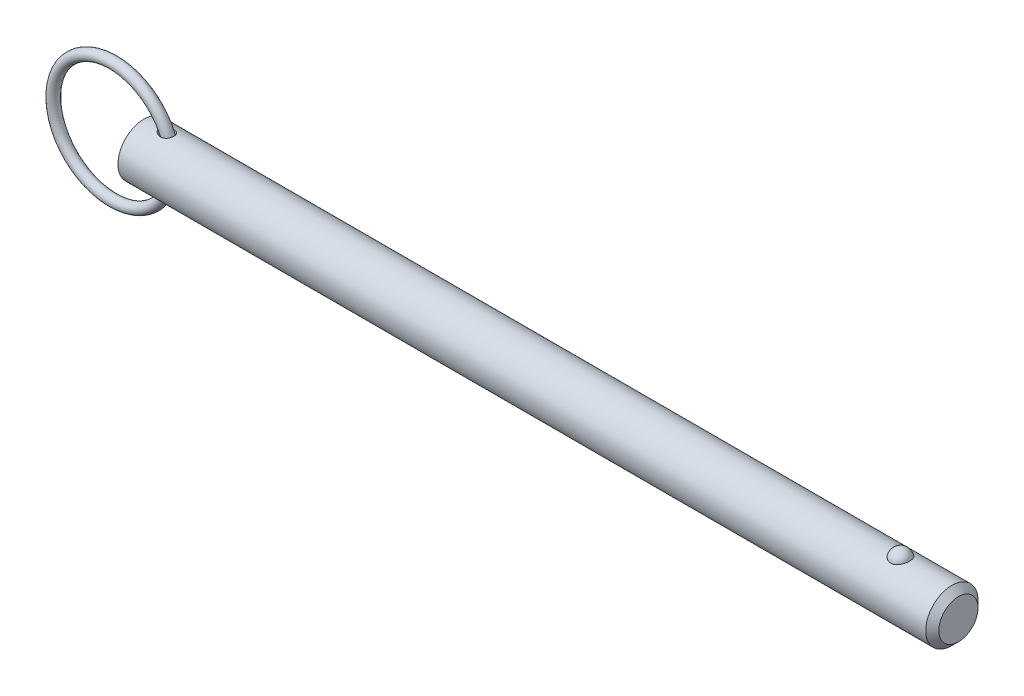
ISO-10303-21;
HEADER;
FILE_DESCRIPTION(('STEP AP214'),'2;1');
FILE_NAME('part.step','',(''),(''),'','','');
FILE_SCHEMA(('AUTOMOTIVE_DESIGN { 1 0 10303 214 1 1 1 1 }'));
ENDSEC;
DATA;
#1=APPLICATION_CONTEXT('core data for automotive mechanical design processes');
#2=APPLICATION_PROTOCOL_DEFINITION('international standard','automotive_design',2000,#1);
#3=PRODUCT_CONTEXT('',#1,'mechanical');
#4=PRODUCT('Part','Part','',(#3));
#5=PRODUCT_RELATED_PRODUCT_CATEGORY('part','',(#4));
#6=PRODUCT_DEFINITION_FORMATION('','',#4);
#7=PRODUCT_DEFINITION_CONTEXT('part definition',#1,'design');
#8=PRODUCT_DEFINITION('design','',#6,#7);
#9=PRODUCT_DEFINITION_SHAPE('','',#8);
#10=(LENGTH_UNIT() NAMED_UNIT(*) SI_UNIT(.MILLI.,.METRE.));
#11=(NAMED_UNIT(*) PLANE_ANGLE_UNIT() SI_UNIT($,.RADIAN.));
#12=(NAMED_UNIT(*) SI_UNIT($,.STERADIAN.) SOLID_ANGLE_UNIT());
#13=UNCERTAINTY_MEASURE_WITH_UNIT(LENGTH_MEASURE(1.E-05),#10,'distance_accuracy_value','');
#14=(GEOMETRIC_REPRESENTATION_CONTEXT(3) GLOBAL_UNCERTAINTY_ASSIGNED_CONTEXT((#13)) GLOBAL_UNIT_ASSIGNED_CONTEXT((#10,
#11,#12)) REPRESENTATION_CONTEXT('',''));
#15=CARTESIAN_POINT('',(0.,0.,0.));
#16=DIRECTION('',(0.,0.,1.));
#17=DIRECTION('',(1.,0.,0.));
#18=AXIS2_PLACEMENT_3D('',#15,#16,#17);
#19=CARTESIAN_POINT('',(-6.5973878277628,0.,0.));
#20=DIRECTION('',(0.,0.,1.));
#21=DIRECTION('',(1.,0.,0.));
#22=AXIS2_PLACEMENT_3D('',#19,#20,#21);
#23=TOROIDAL_SURFACE('',#22,12.7,1.111);
#24=CARTESIAN_POINT('',(7.21361217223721,0.,0.));
#25=VERTEX_POINT('',#24);
#26=VERTEX_LOOP('',#25);
#27=FACE_BOUND('',#26,.T.);
#28=ADVANCED_FACE('P0_F12',(#27),#23,.T.);
#29=CLOSED_SHELL('',(#28));
#30=MANIFOLD_SOLID_BREP('P0_B1',#29);
#31=CARTESIAN_POINT('',(0.,0.,0.));
#32=DIRECTION('',(1.,0.,0.));
#33=DIRECTION('',(0.,0.,-1.));
#34=AXIS2_PLACEMENT_3D('',#31,#32,#33);
#35=CYLINDRICAL_SURFACE('',#34,5.555);
#36=CARTESIAN_POINT('',(3.4079629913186,5.52646850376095,-0.56229074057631));
#37=CARTESIAN_POINT('',(3.45038002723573,5.51879026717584,-0.637753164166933));
#38=CARTESIAN_POINT('',(3.50032814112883,5.50998541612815,-0.70889136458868));
#39=CARTESIAN_POINT('',(3.61174203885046,5.49132550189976,-0.841353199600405));
#40=CARTESIAN_POINT('',(3.67323300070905,5.48146816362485,-0.902654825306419));
#41=CARTESIAN_POINT('',(3.80437942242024,5.46186986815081,-1.01449227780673));
#42=CARTESIAN_POINT('',(3.87396236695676,5.45212862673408,-1.06511378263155));
#43=CARTESIAN_POINT('',(4.01965973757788,5.43359578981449,-1.15594541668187));
#44=CARTESIAN_POINT('',(4.09577226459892,5.42480391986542,-1.19615855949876));
#45=CARTESIAN_POINT('',(4.26620236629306,5.40764958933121,-1.27165209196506));
#46=CARTESIAN_POINT('',(4.36143030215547,5.3996073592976,-1.30496908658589));
#47=CARTESIAN_POINT('',(4.55632904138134,5.38707461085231,-1.35578120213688));
#48=CARTESIAN_POINT('',(4.65600230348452,5.38258608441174,-1.37326745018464));
#49=CARTESIAN_POINT('',(4.85802759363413,5.37803111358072,-1.3910078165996));
#50=CARTESIAN_POINT('',(4.96039620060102,5.37800782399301,-1.39109376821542));
#51=CARTESIAN_POINT('',(5.16321961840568,5.38288845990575,-1.37209481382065));
#52=CARTESIAN_POINT('',(5.2636766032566,5.38778639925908,-1.3530331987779));
#53=CARTESIAN_POINT('',(5.44616808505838,5.40112654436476,-1.29866014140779));
#54=CARTESIAN_POINT('',(5.52893514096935,5.40904875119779,-1.26567968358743));
#55=CARTESIAN_POINT('',(5.68656142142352,5.4273273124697,-1.18484144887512));
#56=CARTESIAN_POINT('',(5.76142575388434,5.43768208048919,-1.13699336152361));
#57=CARTESIAN_POINT('',(5.8928378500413,5.45821422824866,-1.03362464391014));
#58=CARTESIAN_POINT('',(5.95048930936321,5.4682911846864,-0.979480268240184));
#59=CARTESIAN_POINT('',(6.05543937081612,5.48805232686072,-0.861887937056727));
#60=CARTESIAN_POINT('',(6.10274018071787,5.4977365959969,-0.798441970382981));
#61=CARTESIAN_POINT('',(6.18429732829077,5.51527779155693,-0.666351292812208));
#62=CARTESIAN_POINT('',(6.21893047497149,5.52318421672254,-0.597945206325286));
#63=CARTESIAN_POINT('',(6.27643902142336,5.53669785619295,-0.456146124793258));
#64=CARTESIAN_POINT('',(6.299314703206,5.54230512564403,-0.382753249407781));
#65=CARTESIAN_POINT('',(6.33280284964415,5.55061821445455,-0.232999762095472));
#66=CARTESIAN_POINT('',(6.34340498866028,5.55332159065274,-0.156636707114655));
#67=CARTESIAN_POINT('',(6.35208224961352,5.55552923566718,-0.00315477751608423));
#68=CARTESIAN_POINT('',(6.3501570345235,5.55503341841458,0.0739641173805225));
#69=CARTESIAN_POINT('',(6.33379320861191,5.55088854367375,0.22702996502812));
#70=CARTESIAN_POINT('',(6.31931424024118,5.54722931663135,0.302972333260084));
#71=CARTESIAN_POINT('',(6.27810810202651,5.53713917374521,0.451265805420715));
#72=CARTESIAN_POINT('',(6.25138106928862,5.53070828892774,0.523616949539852));
#73=CARTESIAN_POINT('',(6.18634700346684,5.51578851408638,0.662556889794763));
#74=CARTESIAN_POINT('',(6.14805666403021,5.50730259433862,0.729153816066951));
#75=CARTESIAN_POINT('',(6.0608417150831,5.4892059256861,0.854797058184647));
#76=CARTESIAN_POINT('',(6.01191805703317,5.47959527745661,0.91384404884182));
#77=CARTESIAN_POINT('',(5.90496974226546,5.46035411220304,1.0225462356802));
#78=CARTESIAN_POINT('',(5.8469816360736,5.45072382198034,1.07223745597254));
#79=CARTESIAN_POINT('',(5.72342907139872,5.43245016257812,1.16128533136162));
#80=CARTESIAN_POINT('',(5.65786492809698,5.42380675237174,1.20064241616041));
#81=CARTESIAN_POINT('',(5.52033184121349,5.40830592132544,1.26865612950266));
#82=CARTESIAN_POINT('',(5.44830127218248,5.40146883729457,1.2971923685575));
#83=CARTESIAN_POINT('',(5.30051649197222,5.39032432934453,1.34275086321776));
#84=CARTESIAN_POINT('',(5.2247613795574,5.38601752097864,1.35977031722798));
#85=CARTESIAN_POINT('',(5.06697568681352,5.38004503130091,1.3832203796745));
#86=CARTESIAN_POINT('',(4.98483834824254,5.37854992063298,1.38896799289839));
#87=CARTESIAN_POINT('',(4.82062075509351,5.37866467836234,1.38851901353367));
#88=CARTESIAN_POINT('',(4.73854053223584,5.38027567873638,1.38231806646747));
#89=CARTESIAN_POINT('',(4.5665970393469,5.38661928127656,1.35740374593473));
#90=CARTESIAN_POINT('',(4.47694676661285,5.39169506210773,1.33731128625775));
#91=CARTESIAN_POINT('',(4.30168169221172,5.40457769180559,1.28425210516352));
#92=CARTESIAN_POINT('',(4.2160714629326,5.41238755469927,1.25127117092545));
#93=CARTESIAN_POINT('',(4.04117722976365,5.43085841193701,1.16867508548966));
#94=CARTESIAN_POINT('',(3.95261220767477,5.44174460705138,1.11757796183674));
#95=CARTESIAN_POINT('',(3.78568183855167,5.46440376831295,1.00091858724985));
#96=CARTESIAN_POINT('',(3.70730710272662,5.47617590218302,0.935369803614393));
#97=CARTESIAN_POINT('',(3.5829937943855,5.49603821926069,0.809043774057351));
#98=CARTESIAN_POINT('',(3.5339020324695,5.50429522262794,0.751392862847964));
#99=CARTESIAN_POINT('',(3.44556991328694,5.51963490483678,0.628847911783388));
#100=CARTESIAN_POINT('',(3.40631385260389,5.52671944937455,0.563965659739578));
#101=CARTESIAN_POINT('',(3.34553998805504,5.5379053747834,0.439181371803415));
#102=CARTESIAN_POINT('',(3.32216705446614,5.5423057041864,0.380214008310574));
#103=CARTESIAN_POINT('',(3.28543686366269,5.54928356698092,0.259119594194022));
#104=CARTESIAN_POINT('',(3.27207322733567,5.5518622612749,0.196994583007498));
#105=CARTESIAN_POINT('',(3.25633559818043,5.5549036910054,0.0710541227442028));
#106=CARTESIAN_POINT('',(3.25400356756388,5.5553583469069,0.00723314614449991));
#107=CARTESIAN_POINT('',(3.26064251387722,5.55407150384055,-0.119787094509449));
#108=CARTESIAN_POINT('',(3.26961302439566,5.55233009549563,-0.182986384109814));
#109=CARTESIAN_POINT('',(3.29666795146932,5.54714559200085,-0.300518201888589));
#110=CARTESIAN_POINT('',(3.31373453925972,5.54389322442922,-0.355099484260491));
#111=CARTESIAN_POINT('',(3.35543396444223,5.53607951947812,-0.461174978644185));
#112=CARTESIAN_POINT('',(3.38007019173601,5.5315175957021,-0.512667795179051));
#113=CARTESIAN_POINT('',(3.4079629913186,5.52646850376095,-0.56229074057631));
#114=B_SPLINE_CURVE_WITH_KNOTS('',3,(#36,#37,#38,#39,#40,#41,#42,#43,#44,#45,#46,#47,#48,#49,
#50,#51,#52,#53,#54,#55,#56,#57,#58,#59,#60,#61,#62,#63,#64,#65,#66,#67,#68,#69,#70,#71,#72,#73,
#74,#75,#76,#77,#78,#79,#80,#81,#82,#83,#84,#85,#86,#87,#88,#89,#90,#91,#92,#93,#94,#95,#96,#97,
#98,#99,#100,#101,#102,#103,#104,#105,#106,#107,#108,#109,#110,#111,#112,#113),.UNSPECIFIED.,
.T.,.F.,(4,2,2,2,2,2,2,2,2,2,2,2,2,2,2,2,2,2,2,2,2,2,2,2,2,2,2,2,2,2,2,2,2,2,2,2,2,2,4),(0.,
0.260459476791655,0.521493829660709,0.780346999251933,1.03912513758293,1.34137402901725,
1.64379222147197,1.94913302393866,2.25410286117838,2.52092363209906,2.78757087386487,
3.02557563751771,3.26352958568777,3.49368251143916,3.72382991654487,3.9541708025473,
4.18451788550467,4.41560824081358,4.64669600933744,4.87745174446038,5.10818684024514,
5.33801446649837,5.56783253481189,5.80013729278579,6.03249854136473,6.27855081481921,
6.5246927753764,6.79963372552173,7.07487872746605,7.38193573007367,7.68870779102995,
7.91639390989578,8.14371416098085,8.33366541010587,8.52349549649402,8.71404708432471,
8.90459080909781,9.07578823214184,9.24706243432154),.UNSPECIFIED.);
#115=CARTESIAN_POINT('',(3.4079629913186,5.52646850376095,-0.56229074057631));
#116=VERTEX_POINT('',#115);
#117=EDGE_CURVE('P1_E40',#116,#116,#114,.T.);
#118=ORIENTED_EDGE('',*,*,#117,.T.);
#119=EDGE_LOOP('',(#118));
#120=FACE_BOUND('',#119,.T.);
#121=CARTESIAN_POINT('',(171.63125,0.,0.));
#122=DIRECTION('',(1.,0.,0.));
#123=DIRECTION('',(0.,0.,-1.));
#124=AXIS2_PLACEMENT_3D('',#121,#122,#123);
#125=CIRCLE('',#124,5.555);
#126=CARTESIAN_POINT('',(171.63125,0.,-5.555));
#127=VERTEX_POINT('',#126);
#128=EDGE_CURVE('P1_E25',#127,#127,#125,.T.);
#129=ORIENTED_EDGE('',*,*,#128,.F.);
#130=EDGE_LOOP('',(#129));
#131=FACE_BOUND('',#130,.T.);
#132=CARTESIAN_POINT('',(0.,0.,0.));
#133=DIRECTION('',(1.,0.,0.));
#134=DIRECTION('',(0.,0.,-1.));
#135=AXIS2_PLACEMENT_3D('',#132,#133,#134);
#136=CIRCLE('',#135,5.555);
#137=CARTESIAN_POINT('',(0.,0.,-5.555));
#138=VERTEX_POINT('',#137);
#139=EDGE_CURVE('P1_E9',#138,#138,#136,.T.);
#140=ORIENTED_EDGE('',*,*,#139,.T.);
#141=EDGE_LOOP('',(#140));
#142=FACE_BOUND('',#141,.T.);
#143=CARTESIAN_POINT('',(160.718626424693,5.16741224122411,2.03859650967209));
#144=CARTESIAN_POINT('',(160.612949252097,5.16740893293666,2.03859990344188));
#145=CARTESIAN_POINT('',(160.50729894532,5.1707947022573,2.03008306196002));
#146=CARTESIAN_POINT('',(160.299141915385,5.18392795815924,1.99630721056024));
#147=CARTESIAN_POINT('',(160.196634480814,5.19367399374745,1.97105201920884));
#148=CARTESIAN_POINT('',(159.997771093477,5.2183916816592,1.90463997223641));
#149=CARTESIAN_POINT('',(159.901406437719,5.23335573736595,1.86350622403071));
#150=CARTESIAN_POINT('',(159.717080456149,5.26688076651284,1.76652592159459));
#151=CARTESIAN_POINT('',(159.629120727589,5.28544242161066,1.71067657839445));
#152=CARTESIAN_POINT('',(159.461265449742,5.32479845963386,1.583999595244));
#153=CARTESIAN_POINT('',(159.38166564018,5.34564089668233,1.51279545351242));
#154=CARTESIAN_POINT('',(159.23512901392,5.38697258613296,1.35828584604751));
#155=CARTESIAN_POINT('',(159.168194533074,5.40746177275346,1.27497815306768));
#156=CARTESIAN_POINT('',(159.04561039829,5.44694508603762,1.09440293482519));
#157=CARTESIAN_POINT('',(158.990598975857,5.46583143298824,0.99667783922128));
#158=CARTESIAN_POINT('',(158.896937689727,5.49908030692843,0.792961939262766));
#159=CARTESIAN_POINT('',(158.858289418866,5.513442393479,0.686970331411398));
#160=CARTESIAN_POINT('',(158.797680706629,5.536358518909,0.468019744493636));
#161=CARTESIAN_POINT('',(158.775972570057,5.54482455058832,0.35498154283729));
#162=CARTESIAN_POINT('',(158.750636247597,5.55473324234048,0.126595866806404));
#163=CARTESIAN_POINT('',(158.747007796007,5.55617600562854,0.0112484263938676));
#164=CARTESIAN_POINT('',(158.757881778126,5.55189984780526,-0.218011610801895));
#165=CARTESIAN_POINT('',(158.772315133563,5.54620821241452,-0.331928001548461));
#166=CARTESIAN_POINT('',(158.818903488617,5.52828920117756,-0.55554427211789));
#167=CARTESIAN_POINT('',(158.851058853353,5.51606169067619,-0.66524406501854));
#168=CARTESIAN_POINT('',(158.932488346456,5.48630779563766,-0.877469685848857));
#169=CARTESIAN_POINT('',(158.981781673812,5.46877547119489,-0.979987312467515));
#170=CARTESIAN_POINT('',(159.096478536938,5.43024700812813,-1.17486975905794));
#171=CARTESIAN_POINT('',(159.161883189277,5.40925062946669,-1.26723387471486));
#172=CARTESIAN_POINT('',(159.307571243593,5.36600927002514,-1.43940133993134));
#173=CARTESIAN_POINT('',(159.387885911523,5.34376173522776,-1.51917763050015));
#174=CARTESIAN_POINT('',(159.561452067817,5.30057971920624,-1.66360338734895));
#175=CARTESIAN_POINT('',(159.654702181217,5.27964509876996,-1.72825445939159));
#176=CARTESIAN_POINT('',(159.849393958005,5.24205250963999,-1.83909478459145));
#177=CARTESIAN_POINT('',(159.950590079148,5.22530519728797,-1.885684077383));
#178=CARTESIAN_POINT('',(160.160155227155,5.19750919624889,-1.96100802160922));
#179=CARTESIAN_POINT('',(160.268521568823,5.18645838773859,-1.9897493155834));
#180=CARTESIAN_POINT('',(160.483498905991,5.17184410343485,-2.02742262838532));
#181=CARTESIAN_POINT('',(160.589925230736,5.16793282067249,-2.03727608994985));
#182=CARTESIAN_POINT('',(160.802992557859,5.16698995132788,-2.03966777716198));
#183=CARTESIAN_POINT('',(160.909633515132,5.16995704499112,-2.03220932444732));
#184=CARTESIAN_POINT('',(161.116773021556,5.18222383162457,-2.00071170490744));
#185=CARTESIAN_POINT('',(161.217359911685,5.19133213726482,-1.97717337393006));
#186=CARTESIAN_POINT('',(161.413014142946,5.21467637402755,-1.91475248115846));
#187=CARTESIAN_POINT('',(161.508081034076,5.22891272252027,-1.87586867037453));
#188=CARTESIAN_POINT('',(161.692371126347,5.26137066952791,-1.78282713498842));
#189=CARTESIAN_POINT('',(161.781419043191,5.27967329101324,-1.72835124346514));
#190=CARTESIAN_POINT('',(161.949288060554,5.3181741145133,-1.60597483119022));
#191=CARTESIAN_POINT('',(162.028106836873,5.33837274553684,-1.53807126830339));
#192=CARTESIAN_POINT('',(162.177515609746,5.37968287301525,-1.38688970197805));
#193=CARTESIAN_POINT('',(162.247505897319,5.40079011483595,-1.30301744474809));
#194=CARTESIAN_POINT('',(162.373012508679,5.44074401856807,-1.12458170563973));
#195=CARTESIAN_POINT('',(162.428526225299,5.45959027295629,-1.03001630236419));
#196=CARTESIAN_POINT('',(162.525550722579,5.49369849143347,-0.829439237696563));
#197=CARTESIAN_POINT('',(162.56654838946,5.50882422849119,-0.723155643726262));
#198=CARTESIAN_POINT('',(162.631125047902,5.53310911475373,-0.504772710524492));
#199=CARTESIAN_POINT('',(162.654703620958,5.54226812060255,-0.392673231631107));
#200=CARTESIAN_POINT('',(162.684013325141,5.55370358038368,-0.165459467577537));
#201=CARTESIAN_POINT('',(162.689688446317,5.55595843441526,-0.050336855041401));
#202=CARTESIAN_POINT('',(162.682916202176,5.55329317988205,0.179288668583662));
#203=CARTESIAN_POINT('',(162.670469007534,5.54837313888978,0.293791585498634));
#204=CARTESIAN_POINT('',(162.627779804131,5.53189037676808,0.518526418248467));
#205=CARTESIAN_POINT('',(162.597598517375,5.5203503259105,0.628771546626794));
#206=CARTESIAN_POINT('',(162.520096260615,5.49182453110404,0.842318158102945));
#207=CARTESIAN_POINT('',(162.472774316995,5.47483847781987,0.945619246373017));
#208=CARTESIAN_POINT('',(162.361720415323,5.43710633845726,1.14281571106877));
#209=CARTESIAN_POINT('',(162.297921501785,5.41634501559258,1.23667048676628));
#210=CARTESIAN_POINT('',(162.155357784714,5.37334572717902,1.41185243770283));
#211=CARTESIAN_POINT('',(162.07659323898,5.35110778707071,1.49317982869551));
#212=CARTESIAN_POINT('',(161.906423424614,5.30779474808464,1.64049162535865));
#213=CARTESIAN_POINT('',(161.81510026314,5.28671324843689,1.70656877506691));
#214=CARTESIAN_POINT('',(161.62173901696,5.24804852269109,1.82201372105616));
#215=CARTESIAN_POINT('',(161.519700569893,5.23046541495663,1.87138095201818));
#216=CARTESIAN_POINT('',(161.303618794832,5.20042692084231,1.95335298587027));
#217=CARTESIAN_POINT('',(161.189260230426,5.18820192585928,1.98521734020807));
#218=CARTESIAN_POINT('',(160.956130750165,5.17169804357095,2.02783294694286));
#219=CARTESIAN_POINT('',(160.837361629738,5.16741595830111,2.03859269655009));
#220=CARTESIAN_POINT('',(160.718626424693,5.16741224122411,2.03859650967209));
#221=B_SPLINE_CURVE_WITH_KNOTS('',3,(#143,#144,#145,#146,#147,#148,#149,#150,#151,#152,#153,
#154,#155,#156,#157,#158,#159,#160,#161,#162,#163,#164,#165,#166,#167,#168,#169,#170,#171,#172,
#173,#174,#175,#176,#177,#178,#179,#180,#181,#182,#183,#184,#185,#186,#187,#188,#189,#190,#191,
#192,#193,#194,#195,#196,#197,#198,#199,#200,#201,#202,#203,#204,#205,#206,#207,#208,#209,#210,
#211,#212,#213,#214,#215,#216,#217,#218,#219,#220),.UNSPECIFIED.,.T.,.F.,(4,2,2,2,2,2,2,2,2,2,2,
2,2,2,2,2,2,2,2,2,2,2,2,2,2,2,2,2,2,2,2,2,2,2,2,2,2,2,4),(0.,0.316595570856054,
0.633118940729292,0.949183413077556,1.26530783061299,1.59030762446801,1.91536729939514,
2.2549582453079,2.59458224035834,2.93917283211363,3.2837583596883,3.62703002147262,
3.97030875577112,4.31397329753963,4.65766166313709,5.00207904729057,5.34645984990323,
5.68270547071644,6.01882587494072,6.33808403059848,6.65728093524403,6.96696376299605,
7.27667180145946,7.59321535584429,7.90983070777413,8.24210387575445,8.57443684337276,
8.91755896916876,9.26068933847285,9.60489211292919,9.94909164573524,10.2921194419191,
10.6351667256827,10.9796305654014,11.3240884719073,11.6663928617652,12.0087088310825,
12.3645679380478,12.7202837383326),.UNSPECIFIED.);
#222=CARTESIAN_POINT('',(160.718626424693,5.16741224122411,2.03859650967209));
#223=VERTEX_POINT('',#222);
#224=EDGE_CURVE('P1_E34',#223,#223,#221,.T.);
#225=ORIENTED_EDGE('',*,*,#224,.T.);
#226=EDGE_LOOP('',(#225));
#227=FACE_BOUND('',#226,.T.);
#228=CARTESIAN_POINT('',(3.4079629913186,-5.52646850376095,-0.56229074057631));
#229=CARTESIAN_POINT('',(3.37716927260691,-5.53204268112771,-0.507507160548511));
#230=CARTESIAN_POINT('',(3.35034276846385,-5.53702335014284,-0.450440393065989));
#231=CARTESIAN_POINT('',(3.30606625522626,-5.54534377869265,-0.3326552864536));
#232=CARTESIAN_POINT('',(3.28860803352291,-5.5486849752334,-0.271940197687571));
#233=CARTESIAN_POINT('',(3.26421203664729,-5.55337514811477,-0.148013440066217));
#234=CARTESIAN_POINT('',(3.25732647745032,-5.55471423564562,-0.0847909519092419));
#235=CARTESIAN_POINT('',(3.25480623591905,-5.5552029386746,0.0418913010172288));
#236=CARTESIAN_POINT('',(3.25917102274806,-5.55435265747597,0.105351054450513));
#237=CARTESIAN_POINT('',(3.27824306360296,-5.55067444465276,0.227039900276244));
#238=CARTESIAN_POINT('',(3.29237198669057,-5.54795714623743,0.285365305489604));
#239=CARTESIAN_POINT('',(3.32941044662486,-5.54094262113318,0.399033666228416));
#240=CARTESIAN_POINT('',(3.3523223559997,-5.53664496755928,0.454375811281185));
#241=CARTESIAN_POINT('',(3.40768868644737,-5.52648234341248,0.56509977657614));
#242=CARTESIAN_POINT('',(3.4407252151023,-5.52052470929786,0.620179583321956));
#243=CARTESIAN_POINT('',(3.51400705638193,-5.50771567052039,0.725188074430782));
#244=CARTESIAN_POINT('',(3.55425830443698,-5.50086353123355,0.775112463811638));
#245=CARTESIAN_POINT('',(3.66122818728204,-5.48337209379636,0.891977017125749));
#246=CARTESIAN_POINT('',(3.73142715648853,-5.47248221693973,0.955709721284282));
#247=CARTESIAN_POINT('',(3.88137100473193,-5.45112279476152,1.07085228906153));
#248=CARTESIAN_POINT('',(3.96113047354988,-5.44065392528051,1.12224294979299));
#249=CARTESIAN_POINT('',(4.12858826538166,-5.42121387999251,1.21269344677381));
#250=CARTESIAN_POINT('',(4.21635930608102,-5.41225908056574,1.25162207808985));
#251=CARTESIAN_POINT('',(4.39702156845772,-5.39704895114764,1.31566440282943));
#252=CARTESIAN_POINT('',(4.48991226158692,-5.39079334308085,1.34077951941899));
#253=CARTESIAN_POINT('',(4.68604255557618,-5.38154547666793,1.37745897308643));
#254=CARTESIAN_POINT('',(4.78952677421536,-5.37884317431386,1.38782444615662));
#255=CARTESIAN_POINT('',(4.9967070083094,-5.3783992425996,1.38955482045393));
#256=CARTESIAN_POINT('',(5.10040282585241,-5.380654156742,1.380932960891));
#257=CARTESIAN_POINT('',(5.29344112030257,-5.3896561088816,1.34533259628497));
#258=CARTESIAN_POINT('',(5.38316618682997,-5.39591960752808,1.32032381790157));
#259=CARTESIAN_POINT('',(5.55593681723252,-5.41176992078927,1.25376768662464));
#260=CARTESIAN_POINT('',(5.63898852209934,-5.42135363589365,1.2122357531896));
#261=CARTESIAN_POINT('',(5.78518175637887,-5.4411584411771,1.1197110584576));
#262=CARTESIAN_POINT('',(5.84951468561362,-5.45115126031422,1.07054233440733));
#263=CARTESIAN_POINT('',(5.96832363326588,-5.47143247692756,0.961516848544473));
#264=CARTESIAN_POINT('',(6.02280238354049,-5.48172079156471,0.901663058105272));
#265=CARTESIAN_POINT('',(6.11773365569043,-5.50082367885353,0.776380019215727));
#266=CARTESIAN_POINT('',(6.15876077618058,-5.50968670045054,0.711392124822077));
#267=CARTESIAN_POINT('',(6.22940016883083,-5.52555592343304,0.575278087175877));
#268=CARTESIAN_POINT('',(6.25901321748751,-5.53256225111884,0.504152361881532));
#269=CARTESIAN_POINT('',(6.30603044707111,-5.54392803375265,0.35809068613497));
#270=CARTESIAN_POINT('',(6.32348246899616,-5.54829785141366,0.283170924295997));
#271=CARTESIAN_POINT('',(6.34598368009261,-5.5539654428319,0.131376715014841));
#272=CARTESIAN_POINT('',(6.35103253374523,-5.55526313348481,0.054502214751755));
#273=CARTESIAN_POINT('',(6.34861245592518,-5.55464639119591,-0.0993401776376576));
#274=CARTESIAN_POINT('',(6.34109421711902,-5.5527193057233,-0.176307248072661));
#275=CARTESIAN_POINT('',(6.31360904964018,-5.54583593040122,-0.327847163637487));
#276=CARTESIAN_POINT('',(6.29364207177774,-5.54087962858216,-0.402419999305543));
#277=CARTESIAN_POINT('',(6.24170966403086,-5.52847553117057,-0.54704108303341));
#278=CARTESIAN_POINT('',(6.20974488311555,-5.52102787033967,-0.617089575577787));
#279=CARTESIAN_POINT('',(6.13458425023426,-5.5044595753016,-0.750655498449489));
#280=CARTESIAN_POINT('',(6.09138916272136,-5.49533905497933,-0.814173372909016));
#281=CARTESIAN_POINT('',(5.99508306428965,-5.47647644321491,-0.932642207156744));
#282=CARTESIAN_POINT('',(5.94201288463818,-5.46673701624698,-0.987626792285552));
#283=CARTESIAN_POINT('',(5.82732079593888,-5.4476756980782,-1.08787197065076));
#284=CARTESIAN_POINT('',(5.76569959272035,-5.43835377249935,-1.133133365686));
#285=CARTESIAN_POINT('',(5.63545565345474,-5.42108746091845,-1.2130627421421));
#286=CARTESIAN_POINT('',(5.56680798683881,-5.41314827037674,-1.24769112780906));
#287=CARTESIAN_POINT('',(5.42470366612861,-5.39946749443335,-1.30562834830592));
#288=CARTESIAN_POINT('',(5.3512462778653,-5.39372624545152,-1.32893545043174));
#289=CARTESIAN_POINT('',(5.19834649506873,-5.38471871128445,-1.36498831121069));
#290=CARTESIAN_POINT('',(5.11878242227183,-5.38156800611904,-1.37724301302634));
#291=CARTESIAN_POINT('',(4.95867408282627,-5.37830368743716,-1.38993264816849));
#292=CARTESIAN_POINT('',(4.87812945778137,-5.37819121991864,-1.39036312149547));
#293=CARTESIAN_POINT('',(4.70952450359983,-5.38096665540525,-1.37958681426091));
#294=CARTESIAN_POINT('',(4.62154757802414,-5.38416579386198,-1.36717293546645));
#295=CARTESIAN_POINT('',(4.44844201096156,-5.39350862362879,-1.32983172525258));
#296=CARTESIAN_POINT('',(4.36331534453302,-5.39965431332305,-1.30489590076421));
#297=CARTESIAN_POINT('',(4.18705584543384,-5.41508127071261,-1.23943340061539));
#298=CARTESIAN_POINT('',(4.09653169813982,-5.42466147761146,-1.19732979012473));
#299=CARTESIAN_POINT('',(3.92355621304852,-5.44542654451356,-1.09903394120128));
#300=CARTESIAN_POINT('',(3.84111059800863,-5.45661252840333,-1.04283181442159));
#301=CARTESIAN_POINT('',(3.69303712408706,-5.47835672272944,-0.921492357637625));
#302=CARTESIAN_POINT('',(3.62661543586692,-5.4888999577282,-0.857326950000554));
#303=CARTESIAN_POINT('',(3.50663841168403,-5.50887375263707,-0.717815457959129));
#304=CARTESIAN_POINT('',(3.45304856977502,-5.51830726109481,-0.642500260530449));
#305=CARTESIAN_POINT('',(3.4079629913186,-5.52646850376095,-0.56229074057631));
#306=B_SPLINE_CURVE_WITH_KNOTS('',3,(#228,#229,#230,#231,#232,#233,#234,#235,#236,#237,#238,
#239,#240,#241,#242,#243,#244,#245,#246,#247,#248,#249,#250,#251,#252,#253,#254,#255,#256,#257,
#258,#259,#260,#261,#262,#263,#264,#265,#266,#267,#268,#269,#270,#271,#272,#273,#274,#275,#276,
#277,#278,#279,#280,#281,#282,#283,#284,#285,#286,#287,#288,#289,#290,#291,#292,#293,#294,#295,
#296,#297,#298,#299,#300,#301,#302,#303,#304,#305),.UNSPECIFIED.,.T.,.F.,(4,2,2,2,2,2,2,2,2,2,2,
2,2,2,2,2,2,2,2,2,2,2,2,2,2,2,2,2,2,2,2,2,2,2,2,2,2,2,4),(0.,0.189054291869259,
0.377942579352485,0.567760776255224,0.757570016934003,0.937004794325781,1.11648807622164,
1.30929480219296,1.50226088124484,1.78704908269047,2.07227755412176,2.3604171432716,
2.64852704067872,2.95892962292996,3.26911584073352,3.5475451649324,3.82571526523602,
4.06921935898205,4.31265584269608,4.54364944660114,4.77462733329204,5.00469135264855,
5.23476159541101,5.46573664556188,5.69671260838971,5.92767607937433,6.15862383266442,
6.38863707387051,6.61863134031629,6.84947196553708,7.08034790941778,7.32103794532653,
7.56181876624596,7.82747997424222,8.09332161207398,8.39289891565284,8.69268692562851,
8.97023931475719,9.24703674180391),.UNSPECIFIED.);
#307=CARTESIAN_POINT('',(3.4079629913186,-5.52646850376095,-0.56229074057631));
#308=VERTEX_POINT('',#307);
#309=EDGE_CURVE('P1_E17',#308,#308,#306,.T.);
#310=ORIENTED_EDGE('',*,*,#309,.T.);
#311=EDGE_LOOP('',(#310));
#312=FACE_BOUND('',#311,.T.);
#313=ADVANCED_FACE('P1_F13',(#120,#131,#142,#227,#312),#35,.T.);
#314=CARTESIAN_POINT('',(0.,0.,0.));
#315=DIRECTION('',(-1.,0.,0.));
#316=DIRECTION('',(0.,0.,1.));
#317=AXIS2_PLACEMENT_3D('',#314,#315,#316);
#318=PLANE('',#317);
#319=ORIENTED_EDGE('',*,*,#139,.F.);
#320=EDGE_LOOP('',(#319));
#321=FACE_BOUND('',#320,.T.);
#322=ADVANCED_FACE('P1_F15',(#321),#318,.T.);
#323=CARTESIAN_POINT('',(173.02,0.,0.));
#324=DIRECTION('',(-1.,0.,0.));
#325=DIRECTION('',(0.,0.,1.));
#326=AXIS2_PLACEMENT_3D('',#323,#324,#325);
#327=CONICAL_SURFACE('',#326,4.16625000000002,0.785398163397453);
#328=ORIENTED_EDGE('',*,*,#128,.T.);
#329=EDGE_LOOP('',(#328));
#330=FACE_BOUND('',#329,.T.);
#331=CARTESIAN_POINT('',(173.02,0.,0.));
#332=DIRECTION('',(1.,0.,0.));
#333=DIRECTION('',(0.,0.,-1.));
#334=AXIS2_PLACEMENT_3D('',#331,#332,#333);
#335=CIRCLE('',#334,4.16625000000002);
#336=CARTESIAN_POINT('',(173.02,0.,-4.16625000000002));
#337=VERTEX_POINT('',#336);
#338=EDGE_CURVE('P1_E30',#337,#337,#335,.T.);
#339=ORIENTED_EDGE('',*,*,#338,.F.);
#340=EDGE_LOOP('',(#339));
#341=FACE_BOUND('',#340,.T.);
#342=ADVANCED_FACE('P1_F55',(#330,#341),#327,.T.);
#343=CARTESIAN_POINT('',(173.02,4.16625000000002,0.));
#344=DIRECTION('',(1.,0.,0.));
#345=DIRECTION('',(0.,0.,-1.));
#346=AXIS2_PLACEMENT_3D('',#343,#344,#345);
#347=PLANE('',#346);
#348=ORIENTED_EDGE('',*,*,#338,.T.);
#349=EDGE_LOOP('',(#348));
#350=FACE_BOUND('',#349,.T.);
#351=ADVANCED_FACE('P1_F51',(#350),#347,.T.);
#352=CARTESIAN_POINT('',(160.718626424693,4.9995,0.));
#353=DIRECTION('',(-1.,0.,0.));
#354=DIRECTION('',(0.,1.,0.));
#355=AXIS2_PLACEMENT_3D('',#352,#353,#354);
#356=SPHERICAL_SURFACE('',#355,2.04550000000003);
#357=ORIENTED_EDGE('',*,*,#224,.F.);
#358=EDGE_LOOP('',(#357));
#359=FACE_BOUND('',#358,.T.);
#360=ADVANCED_FACE('P1_F46',(#359),#356,.T.);
#361=CARTESIAN_POINT('',(-6.5973878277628,0.,0.));
#362=DIRECTION('',(0.,0.,1.));
#363=DIRECTION('',(1.,0.,0.));
#364=AXIS2_PLACEMENT_3D('',#361,#362,#363);
#365=TOROIDAL_SURFACE('',#364,12.7,1.38875);
#366=ORIENTED_EDGE('',*,*,#309,.F.);
#367=EDGE_LOOP('',(#366));
#368=FACE_BOUND('',#367,.T.);
#369=ORIENTED_EDGE('',*,*,#117,.F.);
#370=EDGE_LOOP('',(#369));
#371=FACE_BOUND('',#370,.T.);
#372=ADVANCED_FACE('P1_F50',(#368,#371),#365,.F.);
#373=CLOSED_SHELL('',(#313,#322,#342,#351,#360,#372));
#374=MANIFOLD_SOLID_BREP('P1_B1',#373);
#375=ADVANCED_BREP_SHAPE_REPRESENTATION('',(#18,#30,#374),#14);
#376=SHAPE_DEFINITION_REPRESENTATION(#9,#375);
ENDSEC;
END-ISO-10303-21;
